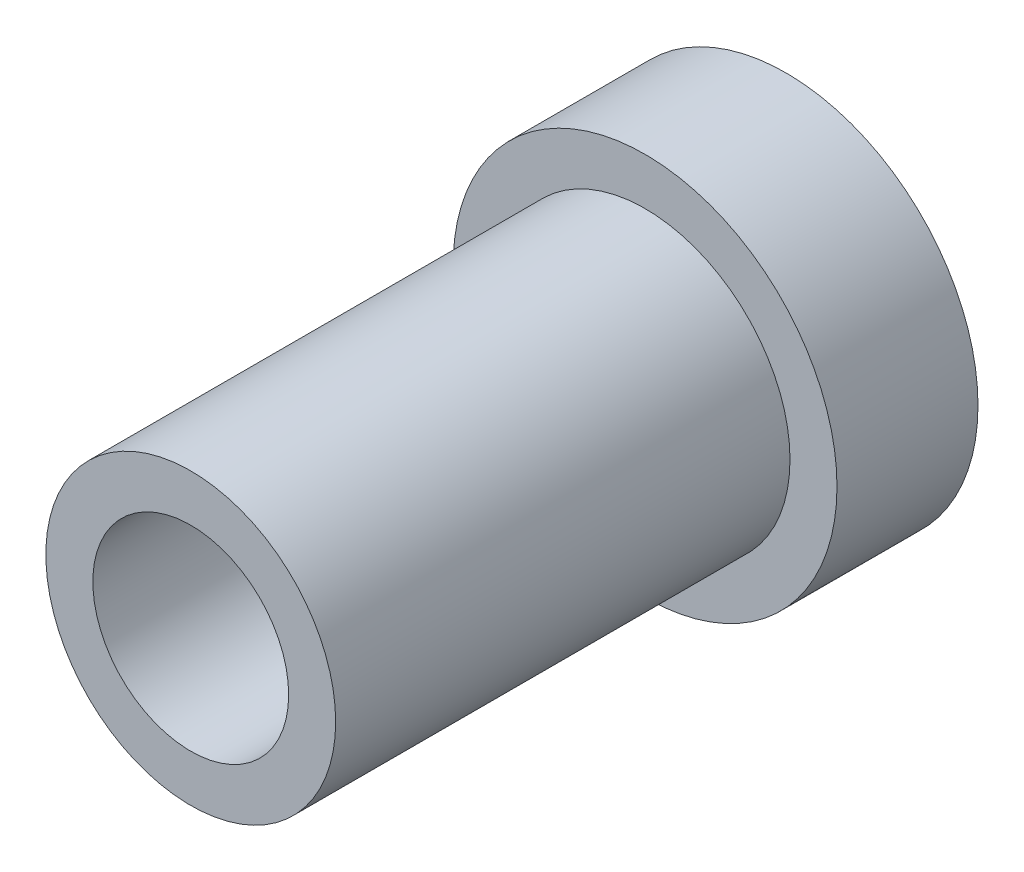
from build123d import *

# Parameters (mm, degrees)
SKETCH1_R          = 6.223
EXTRUDE1_DEPTH     = 4.572
SKETCH2_R          = 4.699
EXTRUDE2_DEPTH     = 14.732
SKETCH3_R          = 2.286
CUT_EXTRUDE1_DEPTH = 22.215463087
SKETCH4_R          = 3.175
CUT_EXTRUDE2_DEPTH = 7.112


with BuildPart() as part:
    # Sketch1 → Extrude1 (new body)
    with BuildSketch(Plane.XY):
        Circle(SKETCH1_R)
    extrude(amount=EXTRUDE1_DEPTH)

    # Sketch2 → Extrude2 (add)
    with BuildSketch(Plane.XY.offset(4.572)):
        Circle(SKETCH2_R)
    extrude(amount=EXTRUDE2_DEPTH)

    # Sketch3 → Cut-Extrude1 (cut, through all)
    with BuildSketch(Plane(origin=(0, 0, 0), x_dir=(-1, 0, 0), z_dir=(0, 0, -1))):
        Circle(SKETCH3_R)
    extrude(amount=-CUT_EXTRUDE1_DEPTH, mode=Mode.SUBTRACT)

    # Sketch4 → Cut-Extrude2 (cut)
    with BuildSketch(Plane.XY.offset(19.304)):
        Circle(SKETCH4_R)
    extrude(amount=-CUT_EXTRUDE2_DEPTH, mode=Mode.SUBTRACT)


solid = part.part
